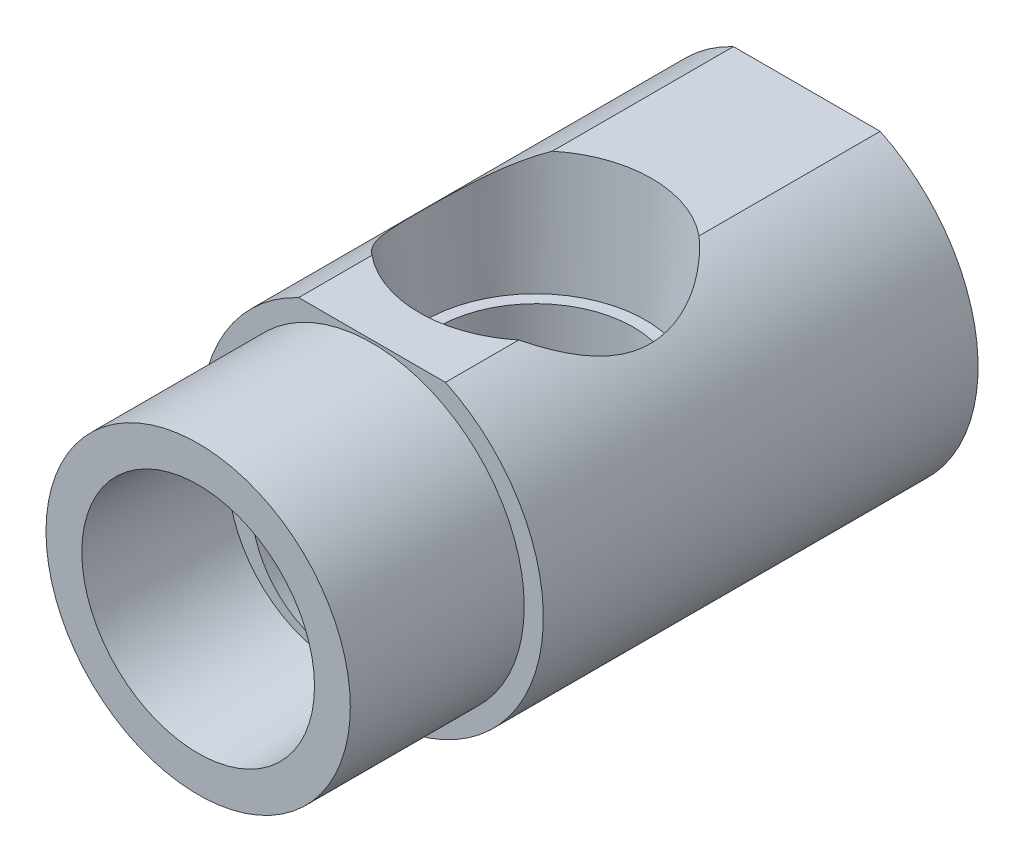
ISO-10303-21;
HEADER;
FILE_DESCRIPTION(('STEP AP214'),'2;1');
FILE_NAME('part.step','',(''),(''),'','','');
FILE_SCHEMA(('AUTOMOTIVE_DESIGN { 1 0 10303 214 1 1 1 1 }'));
ENDSEC;
DATA;
#1=APPLICATION_CONTEXT('core data for automotive mechanical design processes');
#2=APPLICATION_PROTOCOL_DEFINITION('international standard','automotive_design',2000,#1);
#3=PRODUCT_CONTEXT('',#1,'mechanical');
#4=PRODUCT('Part','Part','',(#3));
#5=PRODUCT_RELATED_PRODUCT_CATEGORY('part','',(#4));
#6=PRODUCT_DEFINITION_FORMATION('','',#4);
#7=PRODUCT_DEFINITION_CONTEXT('part definition',#1,'design');
#8=PRODUCT_DEFINITION('design','',#6,#7);
#9=PRODUCT_DEFINITION_SHAPE('','',#8);
#10=(LENGTH_UNIT() NAMED_UNIT(*) SI_UNIT(.MILLI.,.METRE.));
#11=(NAMED_UNIT(*) PLANE_ANGLE_UNIT() SI_UNIT($,.RADIAN.));
#12=(NAMED_UNIT(*) SI_UNIT($,.STERADIAN.) SOLID_ANGLE_UNIT());
#13=UNCERTAINTY_MEASURE_WITH_UNIT(LENGTH_MEASURE(1.E-05),#10,'distance_accuracy_value','');
#14=(GEOMETRIC_REPRESENTATION_CONTEXT(3) GLOBAL_UNCERTAINTY_ASSIGNED_CONTEXT((#13)) GLOBAL_UNIT_ASSIGNED_CONTEXT((#10,
#11,#12)) REPRESENTATION_CONTEXT('',''));
#15=CARTESIAN_POINT('',(0.,0.,0.));
#16=DIRECTION('',(0.,0.,1.));
#17=DIRECTION('',(1.,0.,0.));
#18=AXIS2_PLACEMENT_3D('',#15,#16,#17);
#19=CARTESIAN_POINT('',(0.,-5.49601282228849,-30.7715128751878));
#20=DIRECTION('',(0.,-0.213279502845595,-0.976991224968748));
#21=DIRECTION('',(0.,0.976991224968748,-0.213279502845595));
#22=AXIS2_PLACEMENT_3D('',#19,#20,#21);
#23=CYLINDRICAL_SURFACE('',#22,6.27107494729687);
#24=CARTESIAN_POINT('',(6.1733996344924,-5.4473725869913,-25.379403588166));
#25=CARTESIAN_POINT('',(6.16556245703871,-5.4615694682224,-25.2387089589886));
#26=CARTESIAN_POINT('',(6.15770208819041,-5.47308176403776,-25.0977284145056));
#27=CARTESIAN_POINT('',(6.14232757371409,-5.4903692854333,-24.815371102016));
#28=CARTESIAN_POINT('',(6.1348134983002,-5.4961433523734,-24.6739942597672));
#29=CARTESIAN_POINT('',(6.12053666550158,-5.50157705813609,-24.3912552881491));
#30=CARTESIAN_POINT('',(6.11377297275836,-5.50124439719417,-24.249893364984));
#31=CARTESIAN_POINT('',(6.10130458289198,-5.49432900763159,-23.9672962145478));
#32=CARTESIAN_POINT('',(6.09559978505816,-5.48774687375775,-23.8260609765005));
#33=CARTESIAN_POINT('',(6.08061165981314,-5.4588933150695,-23.4071952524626));
#34=CARTESIAN_POINT('',(6.07322064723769,-5.42759803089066,-23.1300732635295));
#35=CARTESIAN_POINT('',(6.0641492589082,-5.34298500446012,-22.5792315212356));
#36=CARTESIAN_POINT('',(6.06246861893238,-5.28966828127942,-22.305511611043));
#37=CARTESIAN_POINT('',(6.06351201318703,-5.20525205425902,-21.9374242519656));
#38=CARTESIAN_POINT('',(6.06409521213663,-5.18198291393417,-21.8411718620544));
#39=CARTESIAN_POINT('',(6.06581815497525,-5.13337299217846,-21.6492146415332));
#40=CARTESIAN_POINT('',(6.06695777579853,-5.10803266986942,-21.5535096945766));
#41=CARTESIAN_POINT('',(6.06974140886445,-5.05531295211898,-21.3620893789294));
#42=CARTESIAN_POINT('',(6.07138824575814,-5.02792280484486,-21.2663770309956));
#43=CARTESIAN_POINT('',(6.07511895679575,-4.97140456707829,-21.0754629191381));
#44=CARTESIAN_POINT('',(6.0772028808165,-4.94227627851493,-20.9802612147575));
#45=CARTESIAN_POINT('',(6.0794725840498,-4.91236883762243,-20.8853125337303));
#46=B_SPLINE_CURVE_WITH_KNOTS('',3,(#24,#25,#26,#27,#28,#29,#30,#31,#32,#33,#34,#35,#36,#37,#38,
#39,#40,#41,#42,#43,#44,#45),.UNSPECIFIED.,.F.,.F.,(4,2,2,2,2,2,2,2,2,2,4),(0.,
0.424876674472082,0.849839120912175,1.27426575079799,1.69865199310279,2.53445728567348,
3.37022390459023,3.66729136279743,3.96429314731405,4.26297977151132,4.56170049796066),.UNSPECIFIED.);
#47=CARTESIAN_POINT('',(6.0919781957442,-5.48065691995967,-23.7243491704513));
#48=VERTEX_POINT('',#47);
#49=CARTESIAN_POINT('',(6.07945740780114,-4.91256883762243,-20.8859474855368));
#50=VERTEX_POINT('',#49);
#51=EDGE_CURVE('E11',#48,#50,#46,.T.);
#52=ORIENTED_EDGE('',*,*,#51,.F.);
#53=CARTESIAN_POINT('',(0.,-4.02688128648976,-24.0417118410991));
#54=DIRECTION('',(0.,-0.213279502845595,-0.976991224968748));
#55=DIRECTION('',(0.,0.976991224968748,-0.213279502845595));
#56=AXIS2_PLACEMENT_3D('',#53,#54,#55);
#57=CIRCLE('',#56,6.27107494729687);
#58=CARTESIAN_POINT('',(-6.09197819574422,-5.48065691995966,-23.7243491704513));
#59=VERTEX_POINT('',#58);
#60=EDGE_CURVE('E371',#48,#59,#57,.T.);
#61=ORIENTED_EDGE('',*,*,#60,.T.);
#62=CARTESIAN_POINT('',(-6.0794725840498,-4.91236883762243,-20.8853125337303));
#63=CARTESIAN_POINT('',(-6.07573596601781,-4.96156959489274,-21.0415340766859));
#64=CARTESIAN_POINT('',(-6.07250567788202,-5.00867685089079,-21.1984581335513));
#65=CARTESIAN_POINT('',(-6.06733933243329,-5.09790632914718,-21.5138310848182));
#66=CARTESIAN_POINT('',(-6.06540402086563,-5.14002566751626,-21.6722808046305));
#67=CARTESIAN_POINT('',(-6.06311126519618,-5.21852158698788,-21.9910465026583));
#68=CARTESIAN_POINT('',(-6.06275781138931,-5.25488342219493,-22.1513661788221));
#69=CARTESIAN_POINT('',(-6.06387215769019,-5.32085768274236,-22.4733616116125));
#70=CARTESIAN_POINT('',(-6.06533960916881,-5.3504713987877,-22.63503710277));
#71=CARTESIAN_POINT('',(-6.07017346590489,-5.40162696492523,-22.9562006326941));
#72=CARTESIAN_POINT('',(-6.07349982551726,-5.42332359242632,-23.1156644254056));
#73=CARTESIAN_POINT('',(-6.08199666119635,-5.4589193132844,-23.4354291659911));
#74=CARTESIAN_POINT('',(-6.08716726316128,-5.4728178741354,-23.5957301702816));
#75=CARTESIAN_POINT('',(-6.09913989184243,-5.49250235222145,-23.9165225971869));
#76=CARTESIAN_POINT('',(-6.10593942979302,-5.49830055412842,-24.0770133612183));
#77=CARTESIAN_POINT('',(-6.12079517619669,-5.5018556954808,-24.3980021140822));
#78=CARTESIAN_POINT('',(-6.1288511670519,-5.49961402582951,-24.5585000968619));
#79=CARTESIAN_POINT('',(-6.14017047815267,-5.49144391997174,-24.7738735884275));
#80=CARTESIAN_POINT('',(-6.1431078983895,-5.48890223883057,-24.8289128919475));
#81=CARTESIAN_POINT('',(-6.1490461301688,-5.48293652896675,-24.9389390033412));
#82=CARTESIAN_POINT('',(-6.15204693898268,-5.47951253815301,-24.9939258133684));
#83=CARTESIAN_POINT('',(-6.15809935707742,-5.47179157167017,-25.104037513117));
#84=CARTESIAN_POINT('',(-6.16115111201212,-5.46749144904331,-25.1591621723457));
#85=CARTESIAN_POINT('',(-6.16727000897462,-5.45805345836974,-25.2693393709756));
#86=CARTESIAN_POINT('',(-6.17033715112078,-5.45291558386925,-25.3243919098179));
#87=CARTESIAN_POINT('',(-6.1733996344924,-5.4473725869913,-25.379403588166));
#88=B_SPLINE_CURVE_WITH_KNOTS('',3,(#62,#63,#64,#65,#66,#67,#68,#69,#70,#71,#72,#73,#74,#75,#76,
#77,#78,#79,#80,#81,#82,#83,#84,#85,#86,#87),.UNSPECIFIED.,.F.,.F.,(4,2,2,2,2,2,2,2,2,2,2,2,4),
(0.,0.491514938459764,0.983312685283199,1.47635031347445,1.96929355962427,2.45200558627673,
2.93475057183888,3.41676264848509,3.89869134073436,4.06421563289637,4.22973281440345,
4.39585533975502,4.56197914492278),.UNSPECIFIED.);
#89=CARTESIAN_POINT('',(-6.07945740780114,-4.91256883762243,-20.8859474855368));
#90=VERTEX_POINT('',#89);
#91=EDGE_CURVE('E25',#90,#59,#88,.T.);
#92=ORIENTED_EDGE('',*,*,#91,.F.);
#93=CARTESIAN_POINT('',(-3.43816526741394,2.5781,-18.3756745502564));
#94=CARTESIAN_POINT('',(-3.53420964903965,2.50213365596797,-18.428409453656));
#95=CARTESIAN_POINT('',(-3.62756877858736,2.42382017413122,-18.4825369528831));
#96=CARTESIAN_POINT('',(-3.80900853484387,2.26293542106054,-18.5931302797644));
#97=CARTESIAN_POINT('',(-3.89709140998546,2.18036599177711,-18.6495950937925));
#98=CARTESIAN_POINT('',(-4.15335140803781,1.92715515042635,-18.8216726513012));
#99=CARTESIAN_POINT('',(-4.31391172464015,1.75071309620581,-18.9401765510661));
#100=CARTESIAN_POINT('',(-4.61757767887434,1.38252202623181,-19.183276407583));
#101=CARTESIAN_POINT('',(-4.76042428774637,1.1906013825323,-19.3079322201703));
#102=CARTESIAN_POINT('',(-5.02726735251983,0.794965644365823,-19.5588461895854));
#103=CARTESIAN_POINT('',(-5.15125723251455,0.591246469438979,-19.6851048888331));
#104=CARTESIAN_POINT('',(-5.37055249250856,0.191876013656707,-19.92432565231));
#105=CARTESIAN_POINT('',(-5.46744355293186,-0.00281214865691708,-20.0374487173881));
#106=CARTESIAN_POINT('',(-5.64649204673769,-0.401589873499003,-20.2590614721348));
#107=CARTESIAN_POINT('',(-5.72864155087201,-0.605684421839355,-20.3675486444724));
#108=CARTESIAN_POINT('',(-5.87740150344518,-1.02268014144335,-20.5747506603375));
#109=CARTESIAN_POINT('',(-5.94409974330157,-1.23552304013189,-20.6735187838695));
#110=CARTESIAN_POINT('',(-6.06130704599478,-1.6719986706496,-20.8551584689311));
#111=CARTESIAN_POINT('',(-6.11184655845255,-1.8956101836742,-20.9380598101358));
#112=CARTESIAN_POINT('',(-6.18661951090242,-2.31214581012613,-21.0647880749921));
#113=CARTESIAN_POINT('',(-6.21398515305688,-2.50312597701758,-21.1130012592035));
#114=CARTESIAN_POINT('',(-6.25374440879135,-2.89104100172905,-21.1839930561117));
#115=CARTESIAN_POINT('',(-6.26619491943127,-3.08795027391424,-21.2068683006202));
#116=CARTESIAN_POINT('',(-6.27178326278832,-3.38556027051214,-21.2171231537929));
#117=CARTESIAN_POINT('',(-6.27141848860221,-3.48580077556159,-21.2164465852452));
#118=CARTESIAN_POINT('',(-6.2659756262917,-3.68575522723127,-21.2064847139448));
#119=CARTESIAN_POINT('',(-6.26089741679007,-3.78546916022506,-21.1971991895));
#120=CARTESIAN_POINT('',(-6.24590599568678,-3.98355459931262,-21.1700621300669));
#121=CARTESIAN_POINT('',(-6.23598289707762,-4.08192293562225,-21.1521930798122));
#122=CARTESIAN_POINT('',(-6.21135524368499,-4.27622558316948,-21.1084968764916));
#123=CARTESIAN_POINT('',(-6.19665193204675,-4.37216052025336,-21.0826717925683));
#124=CARTESIAN_POINT('',(-6.16585149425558,-4.54317081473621,-21.0295754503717));
#125=CARTESIAN_POINT('',(-6.1505409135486,-4.61876639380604,-21.003496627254));
#126=CARTESIAN_POINT('',(-6.1170900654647,-4.7674707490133,-20.9474755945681));
#127=CARTESIAN_POINT('',(-6.09896284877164,-4.84058918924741,-20.9175513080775));
#128=CARTESIAN_POINT('',(-6.07945740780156,-4.91256883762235,-20.8859474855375));
#129=B_SPLINE_CURVE_WITH_KNOTS('',3,(#93,#94,#95,#96,#97,#98,#99,#100,#101,#102,#103,#104,#105,
#106,#107,#108,#109,#110,#111,#112,#113,#114,#115,#116,#117,#118,#119,#120,#121,#122,#123,#124,
#125,#126,#127,#128),.UNSPECIFIED.,.F.,.F.,(4,2,2,2,2,2,2,2,2,2,2,2,2,2,2,2,2,4),(0.,
0.399852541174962,0.799533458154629,1.59734289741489,2.40570735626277,3.21435307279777,
3.94912566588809,4.68429230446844,5.41517338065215,6.14466894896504,6.73965736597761,
7.33236876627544,7.63267731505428,7.93299359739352,8.23392531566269,8.53477883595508,
8.77886209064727,9.02184639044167),.UNSPECIFIED.);
#130=CARTESIAN_POINT('',(-3.43816526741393,2.5781,-18.3756745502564));
#131=VERTEX_POINT('',#130);
#132=EDGE_CURVE('E247',#131,#90,#129,.T.);
#133=ORIENTED_EDGE('',*,*,#132,.F.);
#134=CARTESIAN_POINT('',(0.,2.5781,6.21440124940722));
#135=DIRECTION('',(0.,-1.,0.));
#136=DIRECTION('',(0.,0.,-1.));
#137=AXIS2_PLACEMENT_3D('',#134,#135,#136);
#138=ELLIPSE('',#137,29.4030831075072,6.27107494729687);
#139=CARTESIAN_POINT('',(-3.70420429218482,2.5781,-17.5111003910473));
#140=VERTEX_POINT('',#139);
#141=EDGE_CURVE('E164',#140,#131,#138,.T.);
#142=ORIENTED_EDGE('',*,*,#141,.F.);
#143=CARTESIAN_POINT('',(3.70443310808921,2.5779,-17.5112311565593));
#144=CARTESIAN_POINT('',(3.5970951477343,2.6717022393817,-17.4498979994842));
#145=CARTESIAN_POINT('',(3.48624807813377,2.76246365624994,-17.390113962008));
#146=CARTESIAN_POINT('',(3.25722442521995,2.93724678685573,-17.274299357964));
#147=CARTESIAN_POINT('',(3.13903756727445,3.02125865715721,-17.2182742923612));
#148=CARTESIAN_POINT('',(2.77171640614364,3.26294533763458,-17.0563063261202));
#149=CARTESIAN_POINT('',(2.51136843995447,3.4088911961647,-16.9573794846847));
#150=CARTESIAN_POINT('',(2.00590411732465,3.64101531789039,-16.7990954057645));
#151=CARTESIAN_POINT('',(1.76465040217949,3.73294421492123,-16.7359858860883));
#152=CARTESIAN_POINT('',(1.3918460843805,3.8448405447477,-16.6589357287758));
#153=CARTESIAN_POINT('',(1.26590096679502,3.87778462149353,-16.6362032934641));
#154=CARTESIAN_POINT('',(1.01102318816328,3.93449294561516,-16.5970260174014));
#155=CARTESIAN_POINT('',(0.88209180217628,3.95826103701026,-16.5805785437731));
#156=CARTESIAN_POINT('',(0.621210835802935,3.99626495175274,-16.5542618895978));
#157=CARTESIAN_POINT('',(0.489246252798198,4.01043128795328,-16.5444406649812));
#158=CARTESIAN_POINT('',(0.224278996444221,4.02864136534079,-16.5318135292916));
#159=CARTESIAN_POINT('',(0.0912763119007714,4.03268499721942,-16.529007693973));
#160=CARTESIAN_POINT('',(-0.174608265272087,4.03055434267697,-16.530485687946));
#161=CARTESIAN_POINT('',(-0.307490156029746,4.02437990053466,-16.5347696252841));
#162=CARTESIAN_POINT('',(-0.57197883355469,4.00195638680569,-16.5503152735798));
#163=CARTESIAN_POINT('',(-0.703585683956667,3.98570782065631,-16.5615766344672));
#164=CARTESIAN_POINT('',(-0.952564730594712,3.94542468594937,-16.5894601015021));
#165=CARTESIAN_POINT('',(-1.07014065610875,3.9222351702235,-16.6054997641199));
#166=CARTESIAN_POINT('',(-1.30270188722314,3.86823414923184,-16.6427932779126));
#167=CARTESIAN_POINT('',(-1.41768640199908,3.83742035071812,-16.6640486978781));
#168=CARTESIAN_POINT('',(-1.75828691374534,3.73411141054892,-16.7351741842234));
#169=CARTESIAN_POINT('',(-1.97917196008,3.65081200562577,-16.7923593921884));
#170=CARTESIAN_POINT('',(-2.4747737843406,3.42843643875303,-16.9441130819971));
#171=CARTESIAN_POINT('',(-2.74340861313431,3.28002750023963,-17.0447910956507));
#172=CARTESIAN_POINT('',(-3.12208662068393,3.03308957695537,-17.2103752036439));
#173=CARTESIAN_POINT('',(-3.24397151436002,2.94698668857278,-17.2678239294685));
#174=CARTESIAN_POINT('',(-3.47994047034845,2.76762000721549,-17.3867169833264));
#175=CARTESIAN_POINT('',(-3.59403717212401,2.67436836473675,-17.4481545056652));
#176=CARTESIAN_POINT('',(-3.70443310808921,2.5779,-17.5112311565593));
#177=B_SPLINE_CURVE_WITH_KNOTS('',3,(#143,#144,#145,#146,#147,#148,#149,#150,#151,#152,#153,
#154,#155,#156,#157,#158,#159,#160,#161,#162,#163,#164,#165,#166,#167,#168,#169,#170,#171,#172,
#173,#174,#175,#176),.UNSPECIFIED.,.F.,.F.,(4,2,2,2,2,2,2,2,2,2,2,2,2,2,2,2,4),(0.,
0.465395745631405,0.931458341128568,1.87031315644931,2.66409541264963,3.06012170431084,
3.45598191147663,3.85467718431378,4.25337676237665,4.65208241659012,5.05076806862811,
5.41310015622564,5.77554135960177,6.50156806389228,7.46553256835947,7.94494386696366,
8.423557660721),.UNSPECIFIED.);
#178=CARTESIAN_POINT('',(3.70420429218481,2.5781,-17.5111003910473));
#179=VERTEX_POINT('',#178);
#180=EDGE_CURVE('E157',#179,#140,#177,.T.);
#181=ORIENTED_EDGE('',*,*,#180,.F.);
#182=CARTESIAN_POINT('',(3.43816526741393,2.5781,-18.3756745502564));
#183=VERTEX_POINT('',#182);
#184=EDGE_CURVE('E251',#183,#179,#138,.T.);
#185=ORIENTED_EDGE('',*,*,#184,.F.);
#186=CARTESIAN_POINT('',(6.07945740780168,-4.91256883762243,-20.8859474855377));
#187=CARTESIAN_POINT('',(6.1055665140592,-4.81628571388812,-20.9282553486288));
#188=CARTESIAN_POINT('',(6.1292001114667,-4.71788768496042,-20.9675365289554));
#189=CARTESIAN_POINT('',(6.17127100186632,-4.51721289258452,-21.0387171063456));
#190=CARTESIAN_POINT('',(6.18969993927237,-4.41493018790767,-21.0706046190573));
#191=CARTESIAN_POINT('',(6.22078607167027,-4.20877254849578,-21.1250960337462));
#192=CARTESIAN_POINT('',(6.23352902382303,-4.10494753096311,-21.1478373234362));
#193=CARTESIAN_POINT('',(6.25351902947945,-3.89521388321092,-21.1837813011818));
#194=CARTESIAN_POINT('',(6.26077029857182,-3.78930691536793,-21.1969913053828));
#195=CARTESIAN_POINT('',(6.26988193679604,-3.57562852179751,-21.2136204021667));
#196=CARTESIAN_POINT('',(6.27169797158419,-3.46784893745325,-21.2169589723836));
#197=CARTESIAN_POINT('',(6.27007497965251,-3.25243674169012,-21.213989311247));
#198=CARTESIAN_POINT('',(6.26663252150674,-3.1448042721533,-21.2076747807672));
#199=CARTESIAN_POINT('',(6.24897707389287,-2.82330740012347,-21.1755363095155));
#200=CARTESIAN_POINT('',(6.22742666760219,-2.61110690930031,-21.1365009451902));
#201=CARTESIAN_POINT('',(6.17571682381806,-2.24792162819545,-21.0463256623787));
#202=CARTESIAN_POINT('',(6.14906219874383,-2.09490854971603,-21.000660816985));
#203=CARTESIAN_POINT('',(6.08782210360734,-1.7938593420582,-20.8990620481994));
#204=CARTESIAN_POINT('',(6.05323128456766,-1.64582664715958,-20.843121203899));
#205=CARTESIAN_POINT('',(5.97667688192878,-1.35399094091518,-20.7236563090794));
#206=CARTESIAN_POINT('',(5.93467802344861,-1.21021219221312,-20.660096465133));
#207=CARTESIAN_POINT('',(5.84384572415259,-0.927238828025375,-20.5278147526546));
#208=CARTESIAN_POINT('',(5.7950100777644,-0.788045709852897,-20.4590912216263));
#209=CARTESIAN_POINT('',(5.65280425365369,-0.414233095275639,-20.2669169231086));
#210=CARTESIAN_POINT('',(5.55288026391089,-0.183853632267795,-20.1400218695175));
#211=CARTESIAN_POINT('',(5.33346573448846,0.265024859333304,-19.8818832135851));
#212=CARTESIAN_POINT('',(5.21396024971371,0.483514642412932,-19.7506363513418));
#213=CARTESIAN_POINT('',(4.95543030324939,0.907202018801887,-19.4887158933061));
#214=CARTESIAN_POINT('',(4.81650190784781,1.11245817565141,-19.3580425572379));
#215=CARTESIAN_POINT('',(4.51780134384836,1.50937282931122,-19.1003059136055));
#216=CARTESIAN_POINT('',(4.35805057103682,1.70104497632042,-18.9732390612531));
#217=CARTESIAN_POINT('',(4.07265974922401,2.00812326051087,-18.7667856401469));
#218=CARTESIAN_POINT('',(3.95308721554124,2.12787528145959,-18.685465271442));
#219=CARTESIAN_POINT('',(3.70351796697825,2.35932971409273,-18.527069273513));
#220=CARTESIAN_POINT('',(3.57351074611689,2.47102379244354,-18.449998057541));
#221=CARTESIAN_POINT('',(3.43816526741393,2.5781,-18.3756745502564));
#222=B_SPLINE_CURVE_WITH_KNOTS('',3,(#186,#187,#188,#189,#190,#191,#192,#193,#194,#195,#196,
#197,#198,#199,#200,#201,#202,#203,#204,#205,#206,#207,#208,#209,#210,#211,#212,#213,#214,#215,
#216,#217,#218,#219,#220,#221),.UNSPECIFIED.,.F.,.F.,(4,2,2,2,2,2,2,2,2,2,2,2,2,2,2,2,2,4),(0.,
0.325146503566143,0.650812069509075,0.971384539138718,1.29171067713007,1.61464263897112,
1.93778541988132,2.58484969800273,3.06995922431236,3.55539667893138,4.04321131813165,
4.53118369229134,5.37412815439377,6.2177189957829,7.05727604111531,7.89597711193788,
8.45876490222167,9.0221266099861),.UNSPECIFIED.);
#223=EDGE_CURVE('E245',#50,#183,#222,.T.);
#224=ORIENTED_EDGE('',*,*,#223,.F.);
#225=EDGE_LOOP('',(#52,#61,#92,#133,#142,#181,#185,#224));
#226=FACE_BOUND('',#225,.T.);
#227=CARTESIAN_POINT('',(0.,-0.997946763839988,-10.1667617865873));
#228=DIRECTION('',(0.,0.,1.));
#229=DIRECTION('',(0.,-1.,0.));
#230=AXIS2_PLACEMENT_3D('',#227,#228,#229);
#231=ELLIPSE('',#230,6.41876281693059,6.27107494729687);
#232=CARTESIAN_POINT('',(0.,-7.41670958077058,-10.1667617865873));
#233=VERTEX_POINT('',#232);
#234=EDGE_CURVE('E20',#233,#233,#231,.T.);
#235=ORIENTED_EDGE('',*,*,#234,.T.);
#236=EDGE_LOOP('',(#235));
#237=FACE_BOUND('',#236,.T.);
#238=ADVANCED_FACE('F16',(#226,#237),#23,.F.);
#239=CARTESIAN_POINT('',(-5.3594,11.3032925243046,0.));
#240=DIRECTION('',(0.,-1.,0.));
#241=DIRECTION('',(0.,0.,-1.));
#242=AXIS2_PLACEMENT_3D('',#239,#240,#241);
#243=PLANE('',#242);
#244=DIRECTION('',(0.,0.,-1.));
#245=VECTOR('',#244,1.);
#246=CARTESIAN_POINT('',(5.3594,11.3032925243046,0.));
#247=LINE('',#246,#245);
#248=CARTESIAN_POINT('',(5.3594,11.3032925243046,-12.7));
#249=VERTEX_POINT('',#248);
#250=CARTESIAN_POINT('',(5.3594,11.3032925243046,-18.05323946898));
#251=VERTEX_POINT('',#250);
#252=EDGE_CURVE('E132',#249,#251,#247,.T.);
#253=ORIENTED_EDGE('',*,*,#252,.T.);
#254=CARTESIAN_POINT('',(0.,11.3032925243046,-24.638));
#255=DIRECTION('',(0.,-1.,0.));
#256=DIRECTION('',(0.,0.,-1.));
#257=AXIS2_PLACEMENT_3D('',#254,#255,#256);
#258=CIRCLE('',#257,8.49012600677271);
#259=CARTESIAN_POINT('',(-5.3594,11.3032925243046,-18.05323946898));
#260=VERTEX_POINT('',#259);
#261=EDGE_CURVE('E118',#251,#260,#258,.T.);
#262=ORIENTED_EDGE('',*,*,#261,.T.);
#263=DIRECTION('',(0.,0.,-1.));
#264=VECTOR('',#263,1.);
#265=CARTESIAN_POINT('',(-5.3594,11.3032925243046,0.));
#266=LINE('',#265,#264);
#267=CARTESIAN_POINT('',(-5.3594,11.3032925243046,-12.7));
#268=VERTEX_POINT('',#267);
#269=EDGE_CURVE('E143',#268,#260,#266,.T.);
#270=ORIENTED_EDGE('',*,*,#269,.F.);
#271=DIRECTION('',(1.,0.,0.));
#272=VECTOR('',#271,1.);
#273=CARTESIAN_POINT('',(-11.1125,11.3032925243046,-12.7));
#274=LINE('',#273,#272);
#275=EDGE_CURVE('E140',#268,#249,#274,.T.);
#276=ORIENTED_EDGE('',*,*,#275,.T.);
#277=EDGE_LOOP('',(#253,#262,#270,#276));
#278=FACE_BOUND('',#277,.T.);
#279=ADVANCED_FACE('F138',(#278),#243,.F.);
#280=CARTESIAN_POINT('',(-7.29488,0.,0.));
#281=DIRECTION('',(0.,0.,1.));
#282=DIRECTION('',(1.,0.,0.));
#283=AXIS2_PLACEMENT_3D('',#280,#281,#282);
#284=PLANE('',#283);
#285=CARTESIAN_POINT('',(0.,0.,0.));
#286=DIRECTION('',(0.,0.,1.));
#287=DIRECTION('',(1.,0.,0.));
#288=AXIS2_PLACEMENT_3D('',#285,#286,#287);
#289=CIRCLE('',#288,8.4963);
#290=CARTESIAN_POINT('',(8.4963,0.,0.));
#291=VERTEX_POINT('',#290);
#292=EDGE_CURVE('E229',#291,#291,#289,.T.);
#293=ORIENTED_EDGE('',*,*,#292,.F.);
#294=EDGE_LOOP('',(#293));
#295=FACE_BOUND('',#294,.T.);
#296=CARTESIAN_POINT('',(0.,0.,0.));
#297=DIRECTION('',(0.,0.,1.));
#298=DIRECTION('',(1.,0.,0.));
#299=AXIS2_PLACEMENT_3D('',#296,#297,#298);
#300=CIRCLE('',#299,11.1125);
#301=CARTESIAN_POINT('',(11.1125,0.,0.));
#302=VERTEX_POINT('',#301);
#303=EDGE_CURVE('E224',#302,#302,#300,.F.);
#304=ORIENTED_EDGE('',*,*,#303,.F.);
#305=EDGE_LOOP('',(#304));
#306=FACE_BOUND('',#305,.T.);
#307=ADVANCED_FACE('F18',(#295,#306),#284,.T.);
#308=CARTESIAN_POINT('',(-12.5095,0.,-44.45));
#309=DIRECTION('',(0.,0.,-1.));
#310=DIRECTION('',(-1.,0.,0.));
#311=AXIS2_PLACEMENT_3D('',#308,#309,#310);
#312=PLANE('',#311);
#313=DIRECTION('',(1.,0.,0.));
#314=VECTOR('',#313,1.);
#315=CARTESIAN_POINT('',(-3.66617420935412,6.35,-44.45));
#316=LINE('',#315,#314);
#317=CARTESIAN_POINT('',(-3.66617420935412,6.35,-44.45));
#318=VERTEX_POINT('',#317);
#319=CARTESIAN_POINT('',(3.66617420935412,6.35,-44.45));
#320=VERTEX_POINT('',#319);
#321=EDGE_CURVE('E369',#318,#320,#316,.T.);
#322=ORIENTED_EDGE('',*,*,#321,.F.);
#323=DIRECTION('',(0.5,0.866025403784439,0.));
#324=VECTOR('',#323,1.);
#325=CARTESIAN_POINT('',(-7.33234841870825,0.,-44.45));
#326=LINE('',#325,#324);
#327=CARTESIAN_POINT('',(-7.33234841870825,0.,-44.45));
#328=VERTEX_POINT('',#327);
#329=EDGE_CURVE('E353',#328,#318,#326,.T.);
#330=ORIENTED_EDGE('',*,*,#329,.F.);
#331=DIRECTION('',(-0.5,0.866025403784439,0.));
#332=VECTOR('',#331,1.);
#333=CARTESIAN_POINT('',(-3.66617420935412,-6.35,-44.45));
#334=LINE('',#333,#332);
#335=CARTESIAN_POINT('',(-3.66617420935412,-6.35,-44.45));
#336=VERTEX_POINT('',#335);
#337=EDGE_CURVE('E357',#336,#328,#334,.T.);
#338=ORIENTED_EDGE('',*,*,#337,.F.);
#339=DIRECTION('',(-1.,0.,0.));
#340=VECTOR('',#339,1.);
#341=CARTESIAN_POINT('',(3.66617420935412,-6.35,-44.45));
#342=LINE('',#341,#340);
#343=CARTESIAN_POINT('',(3.66617420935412,-6.35,-44.45));
#344=VERTEX_POINT('',#343);
#345=EDGE_CURVE('E360',#344,#336,#342,.T.);
#346=ORIENTED_EDGE('',*,*,#345,.F.);
#347=DIRECTION('',(-0.5,-0.866025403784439,0.));
#348=VECTOR('',#347,1.);
#349=CARTESIAN_POINT('',(7.33234841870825,0.,-44.45));
#350=LINE('',#349,#348);
#351=CARTESIAN_POINT('',(7.33234841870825,0.,-44.45));
#352=VERTEX_POINT('',#351);
#353=EDGE_CURVE('E363',#352,#344,#350,.T.);
#354=ORIENTED_EDGE('',*,*,#353,.F.);
#355=DIRECTION('',(0.5,-0.866025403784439,0.));
#356=VECTOR('',#355,1.);
#357=CARTESIAN_POINT('',(3.66617420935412,6.35,-44.45));
#358=LINE('',#357,#356);
#359=EDGE_CURVE('E366',#320,#352,#358,.T.);
#360=ORIENTED_EDGE('',*,*,#359,.F.);
#361=EDGE_LOOP('',(#322,#330,#338,#346,#354,#360));
#362=FACE_BOUND('',#361,.T.);
#363=DIRECTION('',(-1.,0.,0.));
#364=VECTOR('',#363,1.);
#365=CARTESIAN_POINT('',(-5.3594,11.3032925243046,-44.45));
#366=LINE('',#365,#364);
#367=CARTESIAN_POINT('',(5.3594,11.3032925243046,-44.45));
#368=VERTEX_POINT('',#367);
#369=CARTESIAN_POINT('',(-5.3594,11.3032925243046,-44.45));
#370=VERTEX_POINT('',#369);
#371=EDGE_CURVE('E145',#368,#370,#366,.T.);
#372=ORIENTED_EDGE('',*,*,#371,.F.);
#373=CARTESIAN_POINT('',(0.,0.,-44.45));
#374=DIRECTION('',(0.,0.,-1.));
#375=DIRECTION('',(-1.,0.,0.));
#376=AXIS2_PLACEMENT_3D('',#373,#374,#375);
#377=CIRCLE('',#376,12.5095);
#378=EDGE_CURVE('E153',#368,#370,#377,.T.);
#379=ORIENTED_EDGE('',*,*,#378,.T.);
#380=EDGE_LOOP('',(#372,#379));
#381=FACE_BOUND('',#380,.T.);
#382=ADVANCED_FACE('F195',(#362,#381),#312,.T.);
#383=CARTESIAN_POINT('',(0.,0.,-75.1971669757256));
#384=DIRECTION('',(0.,0.,-1.));
#385=DIRECTION('',(-1.,0.,0.));
#386=AXIS2_PLACEMENT_3D('',#383,#384,#385);
#387=CYLINDRICAL_SURFACE('',#386,12.5095);
#388=CARTESIAN_POINT('',(5.3589781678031,11.3034925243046,-18.0528826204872));
#389=CARTESIAN_POINT('',(5.54921369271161,11.2133234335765,-18.2138407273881));
#390=CARTESIAN_POINT('',(5.73165431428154,11.1209258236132,-18.382665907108));
#391=CARTESIAN_POINT('',(6.08048620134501,10.9340894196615,-18.7352208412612));
#392=CARTESIAN_POINT('',(6.24687354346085,10.8396501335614,-18.9189542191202));
#393=CARTESIAN_POINT('',(6.56420314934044,10.6505028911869,-19.3018126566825));
#394=CARTESIAN_POINT('',(6.71502345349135,10.5557980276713,-19.5010405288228));
#395=CARTESIAN_POINT('',(6.99914257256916,10.3695935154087,-19.9128637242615));
#396=CARTESIAN_POINT('',(7.1324444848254,10.2780933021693,-20.1254566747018));
#397=CARTESIAN_POINT('',(7.46650834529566,10.0401700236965,-20.7146742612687));
#398=CARTESIAN_POINT('',(7.65054804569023,9.89929381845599,-21.1034819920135));
#399=CARTESIAN_POINT('',(7.88323238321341,9.71350267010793,-21.7099632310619));
#400=CARTESIAN_POINT('',(7.95350713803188,9.65587918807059,-21.9157452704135));
#401=CARTESIAN_POINT('',(8.07900681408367,9.55112103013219,-22.3345154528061));
#402=CARTESIAN_POINT('',(8.1342346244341,9.50398434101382,-22.5475022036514));
#403=CARTESIAN_POINT('',(8.22106638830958,9.42891275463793,-22.944107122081));
#404=CARTESIAN_POINT('',(8.25505388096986,9.39910020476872,-23.1268521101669));
#405=CARTESIAN_POINT('',(8.31144289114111,9.34927427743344,-23.4954304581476));
#406=CARTESIAN_POINT('',(8.33384667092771,9.32925898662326,-23.6812632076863));
#407=CARTESIAN_POINT('',(8.36672861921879,9.29978140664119,-24.0547275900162));
#408=CARTESIAN_POINT('',(8.37721265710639,9.29031392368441,-24.2423582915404));
#409=CARTESIAN_POINT('',(8.3861052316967,9.28228778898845,-24.6181465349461));
#410=CARTESIAN_POINT('',(8.38451351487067,9.28372936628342,-24.8063040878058));
#411=CARTESIAN_POINT('',(8.36928475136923,9.29746017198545,-25.1816139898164));
#412=CARTESIAN_POINT('',(8.35565497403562,9.30974285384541,-25.3687668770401));
#413=CARTESIAN_POINT('',(8.3165791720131,9.3446659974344,-25.7408437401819));
#414=CARTESIAN_POINT('',(8.2911332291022,9.36730638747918,-25.925767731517));
#415=CARTESIAN_POINT('',(8.22876601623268,9.42213985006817,-26.292394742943));
#416=CARTESIAN_POINT('',(8.19183425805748,9.45434165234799,-26.4740946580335));
#417=CARTESIAN_POINT('',(8.10694730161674,9.52723048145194,-26.8332473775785));
#418=CARTESIAN_POINT('',(8.0589858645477,9.56792230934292,-27.0106977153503));
#419=CARTESIAN_POINT('',(7.93720028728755,9.66935365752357,-27.4109579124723));
#420=CARTESIAN_POINT('',(7.85990590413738,9.73249157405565,-27.6321095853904));
#421=CARTESIAN_POINT('',(7.68886075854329,9.86817719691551,-28.0649768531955));
#422=CARTESIAN_POINT('',(7.59510436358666,9.940728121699,-28.2766891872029));
#423=CARTESIAN_POINT('',(7.39186656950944,10.092770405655,-28.6902308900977));
#424=CARTESIAN_POINT('',(7.28236248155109,10.172271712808,-28.8920454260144));
#425=CARTESIAN_POINT('',(7.04849385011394,10.3357003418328,-29.2848508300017));
#426=CARTESIAN_POINT('',(6.92413202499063,10.4196268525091,-29.4758436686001));
#427=CARTESIAN_POINT('',(6.58695562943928,10.637641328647,-29.9510218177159));
#428=CARTESIAN_POINT('',(6.36373226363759,10.7733928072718,-30.2272036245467));
#429=CARTESIAN_POINT('',(6.00459360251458,10.9750283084,-30.6184604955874));
#430=CARTESIAN_POINT('',(5.88113847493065,11.0417585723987,-30.7447819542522));
#431=CARTESIAN_POINT('',(5.62611191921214,11.1738564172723,-30.9897690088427));
#432=CARTESIAN_POINT('',(5.49453878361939,11.2392237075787,-31.1084329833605));
#433=CARTESIAN_POINT('',(5.3589781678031,11.3034925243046,-31.2231173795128));
#434=B_SPLINE_CURVE_WITH_KNOTS('',3,(#388,#389,#390,#391,#392,#393,#394,#395,#396,#397,#398,
#399,#400,#401,#402,#403,#404,#405,#406,#407,#408,#409,#410,#411,#412,#413,#414,#415,#416,#417,
#418,#419,#420,#421,#422,#423,#424,#425,#426,#427,#428,#429,#430,#431,#432,#433),.UNSPECIFIED.,
.F.,.F.,(4,2,2,2,2,2,2,2,2,2,2,2,2,2,2,2,2,2,2,2,2,2,4),(0.,0.79468460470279,1.58956293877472,
2.39025916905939,3.19081364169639,4.54240556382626,5.21661127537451,5.89068744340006,
6.45486541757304,7.01893316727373,7.58272304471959,8.14652475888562,8.70998624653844,
9.27344383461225,9.83741745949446,10.4017108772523,11.1285534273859,11.8556451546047,
12.5837951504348,13.3118121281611,14.4492964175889,15.0154674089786,15.5817578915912),.UNSPECIFIED.);
#435=CARTESIAN_POINT('',(5.3594,11.3032925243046,-31.2227605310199));
#436=VERTEX_POINT('',#435);
#437=EDGE_CURVE('E32',#251,#436,#434,.T.);
#438=ORIENTED_EDGE('',*,*,#437,.F.);
#439=ORIENTED_EDGE('',*,*,#252,.F.);
#440=CARTESIAN_POINT('',(0.,0.,-12.7));
#441=DIRECTION('',(0.,0.,-1.));
#442=DIRECTION('',(-1.,0.,0.));
#443=AXIS2_PLACEMENT_3D('',#440,#441,#442);
#444=CIRCLE('',#443,12.5095);
#445=EDGE_CURVE('E151',#249,#268,#444,.T.);
#446=ORIENTED_EDGE('',*,*,#445,.T.);
#447=ORIENTED_EDGE('',*,*,#269,.T.);
#448=CARTESIAN_POINT('',(-5.3589781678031,11.3034925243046,-31.2231173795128));
#449=CARTESIAN_POINT('',(-5.54921369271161,11.2133234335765,-31.0621592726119));
#450=CARTESIAN_POINT('',(-5.73165431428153,11.1209258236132,-30.893334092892));
#451=CARTESIAN_POINT('',(-6.08048620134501,10.9340894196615,-30.5407791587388));
#452=CARTESIAN_POINT('',(-6.24687354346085,10.8396501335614,-30.3570457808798));
#453=CARTESIAN_POINT('',(-6.56420314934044,10.6505028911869,-29.9741873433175));
#454=CARTESIAN_POINT('',(-6.71502345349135,10.5557980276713,-29.7749594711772));
#455=CARTESIAN_POINT('',(-6.99914257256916,10.3695935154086,-29.3631362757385));
#456=CARTESIAN_POINT('',(-7.1324444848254,10.2780933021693,-29.1505433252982));
#457=CARTESIAN_POINT('',(-7.46650834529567,10.0401700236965,-28.5613257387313));
#458=CARTESIAN_POINT('',(-7.65054804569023,9.89929381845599,-28.1725180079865));
#459=CARTESIAN_POINT('',(-7.88323238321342,9.71350267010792,-27.5660367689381));
#460=CARTESIAN_POINT('',(-7.95350713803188,9.65587918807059,-27.3602547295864));
#461=CARTESIAN_POINT('',(-8.07900681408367,9.55112103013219,-26.9414845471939));
#462=CARTESIAN_POINT('',(-8.1342346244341,9.50398434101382,-26.7284977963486));
#463=CARTESIAN_POINT('',(-8.22106638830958,9.42891275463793,-26.331892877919));
#464=CARTESIAN_POINT('',(-8.25505388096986,9.39910020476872,-26.1491478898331));
#465=CARTESIAN_POINT('',(-8.31144289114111,9.34927427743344,-25.7805695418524));
#466=CARTESIAN_POINT('',(-8.33384667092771,9.32925898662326,-25.5947367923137));
#467=CARTESIAN_POINT('',(-8.36672861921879,9.29978140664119,-25.2212724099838));
#468=CARTESIAN_POINT('',(-8.37721265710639,9.29031392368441,-25.0336417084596));
#469=CARTESIAN_POINT('',(-8.3861052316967,9.28228778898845,-24.6578534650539));
#470=CARTESIAN_POINT('',(-8.38451351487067,9.28372936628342,-24.4696959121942));
#471=CARTESIAN_POINT('',(-8.36928475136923,9.29746017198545,-24.0943860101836));
#472=CARTESIAN_POINT('',(-8.35565497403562,9.30974285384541,-23.9072331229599));
#473=CARTESIAN_POINT('',(-8.3165791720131,9.3446659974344,-23.5351562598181));
#474=CARTESIAN_POINT('',(-8.2911332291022,9.36730638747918,-23.350232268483));
#475=CARTESIAN_POINT('',(-8.22876601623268,9.42213985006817,-22.983605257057));
#476=CARTESIAN_POINT('',(-8.19183425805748,9.45434165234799,-22.8019053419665));
#477=CARTESIAN_POINT('',(-8.10694730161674,9.52723048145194,-22.4427526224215));
#478=CARTESIAN_POINT('',(-8.0589858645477,9.56792230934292,-22.2653022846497));
#479=CARTESIAN_POINT('',(-7.93720028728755,9.66935365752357,-21.8650420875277));
#480=CARTESIAN_POINT('',(-7.85990590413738,9.73249157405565,-21.6438904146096));
#481=CARTESIAN_POINT('',(-7.68886075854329,9.86817719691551,-21.2110231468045));
#482=CARTESIAN_POINT('',(-7.59510436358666,9.940728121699,-20.9993108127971));
#483=CARTESIAN_POINT('',(-7.39186656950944,10.092770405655,-20.5857691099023));
#484=CARTESIAN_POINT('',(-7.28236248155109,10.172271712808,-20.3839545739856));
#485=CARTESIAN_POINT('',(-7.04849385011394,10.3357003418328,-19.9911491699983));
#486=CARTESIAN_POINT('',(-6.92413202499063,10.4196268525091,-19.8001563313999));
#487=CARTESIAN_POINT('',(-6.58695562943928,10.637641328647,-19.3249781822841));
#488=CARTESIAN_POINT('',(-6.36373226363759,10.7733928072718,-19.0487963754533));
#489=CARTESIAN_POINT('',(-6.00459360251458,10.9750283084,-18.6575395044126));
#490=CARTESIAN_POINT('',(-5.88113847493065,11.0417585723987,-18.5312180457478));
#491=CARTESIAN_POINT('',(-5.62611191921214,11.1738564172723,-18.2862309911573));
#492=CARTESIAN_POINT('',(-5.49453878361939,11.2392237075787,-18.1675670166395));
#493=CARTESIAN_POINT('',(-5.3589781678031,11.3034925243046,-18.0528826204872));
#494=B_SPLINE_CURVE_WITH_KNOTS('',3,(#448,#449,#450,#451,#452,#453,#454,#455,#456,#457,#458,
#459,#460,#461,#462,#463,#464,#465,#466,#467,#468,#469,#470,#471,#472,#473,#474,#475,#476,#477,
#478,#479,#480,#481,#482,#483,#484,#485,#486,#487,#488,#489,#490,#491,#492,#493),.UNSPECIFIED.,
.F.,.F.,(4,2,2,2,2,2,2,2,2,2,2,2,2,2,2,2,2,2,2,2,2,2,4),(0.,0.794684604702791,1.58956293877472,
2.39025916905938,3.19081364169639,4.54240556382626,5.21661127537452,5.89068744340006,
6.45486541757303,7.01893316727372,7.58272304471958,8.14652475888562,8.70998624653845,
9.27344383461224,9.83741745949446,10.4017108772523,11.1285534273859,11.8556451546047,
12.5837951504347,13.3118121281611,14.4492964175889,15.0154674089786,15.5817578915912),.UNSPECIFIED.);
#495=CARTESIAN_POINT('',(-5.3594,11.3032925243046,-31.2227605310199));
#496=VERTEX_POINT('',#495);
#497=EDGE_CURVE('E121',#496,#260,#494,.T.);
#498=ORIENTED_EDGE('',*,*,#497,.F.);
#499=EDGE_CURVE('E141',#496,#370,#266,.T.);
#500=ORIENTED_EDGE('',*,*,#499,.T.);
#501=ORIENTED_EDGE('',*,*,#378,.F.);
#502=EDGE_CURVE('E135',#436,#368,#247,.T.);
#503=ORIENTED_EDGE('',*,*,#502,.F.);
#504=EDGE_LOOP('',(#438,#439,#446,#447,#498,#500,#501,#503));
#505=FACE_BOUND('',#504,.T.);
#506=ADVANCED_FACE('F130',(#505),#387,.T.);
#507=CARTESIAN_POINT('',(-11.1125,0.,-12.7));
#508=DIRECTION('',(0.,0.,1.));
#509=DIRECTION('',(1.,0.,0.));
#510=AXIS2_PLACEMENT_3D('',#507,#508,#509);
#511=PLANE('',#510);
#512=ORIENTED_EDGE('',*,*,#275,.F.);
#513=ORIENTED_EDGE('',*,*,#445,.F.);
#514=EDGE_LOOP('',(#512,#513));
#515=FACE_BOUND('',#514,.T.);
#516=CARTESIAN_POINT('',(0.,0.,-12.7));
#517=DIRECTION('',(0.,0.,-1.));
#518=DIRECTION('',(-1.,0.,0.));
#519=AXIS2_PLACEMENT_3D('',#516,#517,#518);
#520=CIRCLE('',#519,11.1125);
#521=CARTESIAN_POINT('',(-11.1125,0.,-12.7));
#522=VERTEX_POINT('',#521);
#523=EDGE_CURVE('E148',#522,#522,#520,.T.);
#524=ORIENTED_EDGE('',*,*,#523,.T.);
#525=EDGE_LOOP('',(#524));
#526=FACE_BOUND('',#525,.T.);
#527=ADVANCED_FACE('F194',(#515,#526),#511,.T.);
#528=CARTESIAN_POINT('',(0.,0.,-75.1971669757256));
#529=DIRECTION('',(0.,0.,-1.));
#530=DIRECTION('',(-1.,0.,0.));
#531=AXIS2_PLACEMENT_3D('',#528,#529,#530);
#532=CYLINDRICAL_SURFACE('',#531,11.1125);
#533=ORIENTED_EDGE('',*,*,#523,.F.);
#534=EDGE_LOOP('',(#533));
#535=FACE_BOUND('',#534,.T.);
#536=ORIENTED_EDGE('',*,*,#303,.T.);
#537=EDGE_LOOP('',(#536));
#538=FACE_BOUND('',#537,.T.);
#539=ADVANCED_FACE('F318',(#535,#538),#532,.T.);
#540=ORIENTED_EDGE('',*,*,#499,.F.);
#541=EDGE_CURVE('E125',#496,#436,#258,.T.);
#542=ORIENTED_EDGE('',*,*,#541,.T.);
#543=ORIENTED_EDGE('',*,*,#502,.T.);
#544=ORIENTED_EDGE('',*,*,#371,.T.);
#545=EDGE_LOOP('',(#540,#542,#543,#544));
#546=FACE_BOUND('',#545,.T.);
#547=ADVANCED_FACE('F215',(#546),#243,.F.);
#548=CARTESIAN_POINT('',(-3.66617420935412,6.35,-38.1));
#549=DIRECTION('',(0.,1.,0.));
#550=DIRECTION('',(-1.,0.,0.));
#551=AXIS2_PLACEMENT_3D('',#548,#549,#550);
#552=PLANE('',#551);
#553=ORIENTED_EDGE('',*,*,#321,.T.);
#554=DIRECTION('',(0.,0.,-1.));
#555=VECTOR('',#554,1.);
#556=CARTESIAN_POINT('',(3.66617420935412,6.35,-38.1));
#557=LINE('',#556,#555);
#558=CARTESIAN_POINT('',(3.66617420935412,6.35,-38.1));
#559=VERTEX_POINT('',#558);
#560=EDGE_CURVE('E342',#559,#320,#557,.T.);
#561=ORIENTED_EDGE('',*,*,#560,.F.);
#562=DIRECTION('',(1.,0.,0.));
#563=VECTOR('',#562,1.);
#564=CARTESIAN_POINT('',(-3.66617420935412,6.35,-38.1));
#565=LINE('',#564,#563);
#566=CARTESIAN_POINT('',(-3.66617420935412,6.35,-38.1));
#567=VERTEX_POINT('',#566);
#568=EDGE_CURVE('E356',#567,#559,#565,.T.);
#569=ORIENTED_EDGE('',*,*,#568,.F.);
#570=DIRECTION('',(0.,0.,-1.));
#571=VECTOR('',#570,1.);
#572=CARTESIAN_POINT('',(-3.66617420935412,6.35,-38.1));
#573=LINE('',#572,#571);
#574=EDGE_CURVE('E338',#567,#318,#573,.T.);
#575=ORIENTED_EDGE('',*,*,#574,.T.);
#576=EDGE_LOOP('',(#553,#561,#569,#575));
#577=FACE_BOUND('',#576,.T.);
#578=ADVANCED_FACE('F299',(#577),#552,.F.);
#579=CARTESIAN_POINT('',(-7.33234841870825,0.,-38.1));
#580=DIRECTION('',(-0.866025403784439,0.5,0.));
#581=DIRECTION('',(-0.5,-0.866025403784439,0.));
#582=AXIS2_PLACEMENT_3D('',#579,#580,#581);
#583=PLANE('',#582);
#584=ORIENTED_EDGE('',*,*,#329,.T.);
#585=ORIENTED_EDGE('',*,*,#574,.F.);
#586=DIRECTION('',(0.5,0.866025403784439,0.));
#587=VECTOR('',#586,1.);
#588=CARTESIAN_POINT('',(-7.33234841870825,0.,-38.1));
#589=LINE('',#588,#587);
#590=CARTESIAN_POINT('',(-7.33234841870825,0.,-38.1));
#591=VERTEX_POINT('',#590);
#592=EDGE_CURVE('E346',#591,#567,#589,.T.);
#593=ORIENTED_EDGE('',*,*,#592,.F.);
#594=DIRECTION('',(0.,0.,-1.));
#595=VECTOR('',#594,1.);
#596=CARTESIAN_POINT('',(-7.33234841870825,0.,-38.1));
#597=LINE('',#596,#595);
#598=EDGE_CURVE('E339',#591,#328,#597,.T.);
#599=ORIENTED_EDGE('',*,*,#598,.T.);
#600=EDGE_LOOP('',(#584,#585,#593,#599));
#601=FACE_BOUND('',#600,.T.);
#602=ADVANCED_FACE('F295',(#601),#583,.F.);
#603=CARTESIAN_POINT('',(-3.66617420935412,-6.35,-38.1));
#604=DIRECTION('',(-0.866025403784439,-0.5,0.));
#605=DIRECTION('',(0.5,-0.866025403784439,0.));
#606=AXIS2_PLACEMENT_3D('',#603,#604,#605);
#607=PLANE('',#606);
#608=ORIENTED_EDGE('',*,*,#337,.T.);
#609=ORIENTED_EDGE('',*,*,#598,.F.);
#610=DIRECTION('',(-0.5,0.866025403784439,0.));
#611=VECTOR('',#610,1.);
#612=CARTESIAN_POINT('',(-3.66617420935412,-6.35,-38.1));
#613=LINE('',#612,#611);
#614=CARTESIAN_POINT('',(-3.66617420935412,-6.35,-38.1));
#615=VERTEX_POINT('',#614);
#616=EDGE_CURVE('E374',#615,#591,#613,.T.);
#617=ORIENTED_EDGE('',*,*,#616,.F.);
#618=DIRECTION('',(0.,0.,-1.));
#619=VECTOR('',#618,1.);
#620=CARTESIAN_POINT('',(-3.66617420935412,-6.35,-38.1));
#621=LINE('',#620,#619);
#622=EDGE_CURVE('E350',#615,#336,#621,.T.);
#623=ORIENTED_EDGE('',*,*,#622,.T.);
#624=EDGE_LOOP('',(#608,#609,#617,#623));
#625=FACE_BOUND('',#624,.T.);
#626=ADVANCED_FACE('F298',(#625),#607,.F.);
#627=CARTESIAN_POINT('',(3.66617420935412,-6.35,-38.1));
#628=DIRECTION('',(0.,-1.,0.));
#629=DIRECTION('',(1.,0.,0.));
#630=AXIS2_PLACEMENT_3D('',#627,#628,#629);
#631=PLANE('',#630);
#632=ORIENTED_EDGE('',*,*,#345,.T.);
#633=ORIENTED_EDGE('',*,*,#622,.F.);
#634=DIRECTION('',(-1.,0.,0.));
#635=VECTOR('',#634,1.);
#636=CARTESIAN_POINT('',(3.66617420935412,-6.35,-38.1));
#637=LINE('',#636,#635);
#638=CARTESIAN_POINT('',(3.66617420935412,-6.35,-38.1));
#639=VERTEX_POINT('',#638);
#640=EDGE_CURVE('E377',#639,#615,#637,.T.);
#641=ORIENTED_EDGE('',*,*,#640,.F.);
#642=DIRECTION('',(0.,0.,-1.));
#643=VECTOR('',#642,1.);
#644=CARTESIAN_POINT('',(3.66617420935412,-6.35,-38.1));
#645=LINE('',#644,#643);
#646=EDGE_CURVE('E348',#639,#344,#645,.T.);
#647=ORIENTED_EDGE('',*,*,#646,.T.);
#648=EDGE_LOOP('',(#632,#633,#641,#647));
#649=FACE_BOUND('',#648,.T.);
#650=ADVANCED_FACE('F303',(#649),#631,.F.);
#651=CARTESIAN_POINT('',(7.33234841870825,0.,-38.1));
#652=DIRECTION('',(0.866025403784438,-0.5,0.));
#653=DIRECTION('',(0.5,0.866025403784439,0.));
#654=AXIS2_PLACEMENT_3D('',#651,#652,#653);
#655=PLANE('',#654);
#656=ORIENTED_EDGE('',*,*,#353,.T.);
#657=ORIENTED_EDGE('',*,*,#646,.F.);
#658=DIRECTION('',(-0.5,-0.866025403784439,0.));
#659=VECTOR('',#658,1.);
#660=CARTESIAN_POINT('',(7.33234841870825,0.,-38.1));
#661=LINE('',#660,#659);
#662=CARTESIAN_POINT('',(7.33234841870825,0.,-38.1));
#663=VERTEX_POINT('',#662);
#664=EDGE_CURVE('E380',#663,#639,#661,.T.);
#665=ORIENTED_EDGE('',*,*,#664,.F.);
#666=DIRECTION('',(0.,0.,-1.));
#667=VECTOR('',#666,1.);
#668=CARTESIAN_POINT('',(7.33234841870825,0.,-38.1));
#669=LINE('',#668,#667);
#670=EDGE_CURVE('E345',#663,#352,#669,.T.);
#671=ORIENTED_EDGE('',*,*,#670,.T.);
#672=EDGE_LOOP('',(#656,#657,#665,#671));
#673=FACE_BOUND('',#672,.T.);
#674=ADVANCED_FACE('F307',(#673),#655,.F.);
#675=CARTESIAN_POINT('',(3.66617420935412,6.35,-38.1));
#676=DIRECTION('',(0.866025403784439,0.5,0.));
#677=DIRECTION('',(-0.5,0.866025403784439,0.));
#678=AXIS2_PLACEMENT_3D('',#675,#676,#677);
#679=PLANE('',#678);
#680=ORIENTED_EDGE('',*,*,#359,.T.);
#681=ORIENTED_EDGE('',*,*,#670,.F.);
#682=DIRECTION('',(0.5,-0.866025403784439,0.));
#683=VECTOR('',#682,1.);
#684=CARTESIAN_POINT('',(3.66617420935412,6.35,-38.1));
#685=LINE('',#684,#683);
#686=EDGE_CURVE('E383',#559,#663,#685,.T.);
#687=ORIENTED_EDGE('',*,*,#686,.F.);
#688=ORIENTED_EDGE('',*,*,#560,.T.);
#689=EDGE_LOOP('',(#680,#681,#687,#688));
#690=FACE_BOUND('',#689,.T.);
#691=ADVANCED_FACE('F293',(#690),#679,.F.);
#692=CARTESIAN_POINT('',(0.,0.,-38.1));
#693=DIRECTION('',(0.,0.,-1.));
#694=DIRECTION('',(-1.,0.,0.));
#695=AXIS2_PLACEMENT_3D('',#692,#693,#694);
#696=PLANE('',#695);
#697=ORIENTED_EDGE('',*,*,#568,.T.);
#698=ORIENTED_EDGE('',*,*,#686,.T.);
#699=ORIENTED_EDGE('',*,*,#664,.T.);
#700=ORIENTED_EDGE('',*,*,#640,.T.);
#701=ORIENTED_EDGE('',*,*,#616,.T.);
#702=ORIENTED_EDGE('',*,*,#592,.T.);
#703=EDGE_LOOP('',(#697,#698,#699,#700,#701,#702));
#704=FACE_BOUND('',#703,.T.);
#705=ADVANCED_FACE('F288',(#704),#696,.T.);
#706=CARTESIAN_POINT('',(0.,-4.02688128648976,-24.0417118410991));
#707=DIRECTION('',(0.,0.213279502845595,0.976991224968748));
#708=DIRECTION('',(0.,-0.976991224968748,0.213279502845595));
#709=AXIS2_PLACEMENT_3D('',#706,#707,#708);
#710=CONICAL_SURFACE('',#709,6.27107494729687,0.738529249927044);
#711=CARTESIAN_POINT('',(0.,-7.8171617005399,-26.7511650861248));
#712=CARTESIAN_POINT('',(0.0306488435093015,-7.81716198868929,-26.7511654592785));
#713=CARTESIAN_POINT('',(0.0612977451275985,-7.81694149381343,-26.7508798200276));
#714=CARTESIAN_POINT('',(0.1297667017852,-7.81595747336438,-26.749605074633));
#715=CARTESIAN_POINT('',(0.167582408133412,-7.81507869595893,-26.7484666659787));
#716=CARTESIAN_POINT('',(0.243722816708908,-7.81263621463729,-26.745302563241));
#717=CARTESIAN_POINT('',(0.282046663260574,-7.81106245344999,-26.743263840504));
#718=CARTESIAN_POINT('',(0.338345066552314,-7.80824831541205,-26.7396182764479));
#719=CARTESIAN_POINT('',(0.356356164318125,-7.80727222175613,-26.7383537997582));
#720=CARTESIAN_POINT('',(0.446379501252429,-7.8020163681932,-26.7315451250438));
#721=CARTESIAN_POINT('',(0.51822164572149,-7.7966139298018,-26.7245465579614));
#722=CARTESIAN_POINT('',(0.733733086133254,-7.77685263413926,-26.6989468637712));
#723=CARTESIAN_POINT('',(0.876563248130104,-7.75896145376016,-26.6757697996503));
#724=CARTESIAN_POINT('',(1.15867598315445,-7.71482779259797,-26.6185970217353));
#725=CARTESIAN_POINT('',(1.29795748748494,-7.68858282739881,-26.5845980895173));
#726=CARTESIAN_POINT('',(1.61886317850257,-7.61887623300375,-26.4942969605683));
#727=CARTESIAN_POINT('',(1.79884032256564,-7.57259419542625,-26.4343410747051));
#728=CARTESIAN_POINT('',(2.15114857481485,-7.4701105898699,-26.3015790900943));
#729=CARTESIAN_POINT('',(2.32347015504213,-7.41389707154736,-26.2287575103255));
#730=CARTESIAN_POINT('',(2.66304496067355,-7.29317142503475,-26.0723639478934));
#731=CARTESIAN_POINT('',(2.83020459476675,-7.22856193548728,-25.9886658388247));
#732=CARTESIAN_POINT('',(3.07597005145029,-7.12727098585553,-25.857448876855));
#733=CARTESIAN_POINT('',(3.15704408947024,-7.09278664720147,-25.812776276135));
#734=CARTESIAN_POINT('',(3.31767893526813,-7.02252656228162,-25.7217581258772));
#735=CARTESIAN_POINT('',(3.39723977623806,-6.98675084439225,-25.6754126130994));
#736=CARTESIAN_POINT('',(3.62832422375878,-6.88026489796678,-25.5374658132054));
#737=CARTESIAN_POINT('',(3.77794772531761,-6.80801352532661,-25.4438680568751));
#738=CARTESIAN_POINT('',(4.07276390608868,-6.66019905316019,-25.2523823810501));
#739=CARTESIAN_POINT('',(4.21795568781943,-6.58463529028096,-25.1544936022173));
#740=CARTESIAN_POINT('',(4.50463813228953,-6.43081711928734,-24.9552304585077));
#741=CARTESIAN_POINT('',(4.64612614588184,-6.35256087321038,-24.8538537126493));
#742=CARTESIAN_POINT('',(4.92585635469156,-6.19390612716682,-24.6483250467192));
#743=CARTESIAN_POINT('',(5.06409831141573,-6.11350747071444,-24.5441729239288));
#744=CARTESIAN_POINT('',(5.33830269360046,-5.95065173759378,-24.3332021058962));
#745=CARTESIAN_POINT('',(5.47425459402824,-5.86818805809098,-24.2263748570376));
#746=CARTESIAN_POINT('',(5.74373112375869,-5.70179106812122,-24.0108165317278));
#747=CARTESIAN_POINT('',(5.8772556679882,-5.61785770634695,-23.9020853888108));
#748=CARTESIAN_POINT('',(6.27471014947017,-5.36420563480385,-23.5734928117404));
#749=CARTESIAN_POINT('',(6.53550012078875,-5.19264744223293,-23.3512484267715));
#750=CARTESIAN_POINT('',(6.90967614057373,-4.94086927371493,-23.0250833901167));
#751=CARTESIAN_POINT('',(7.02561522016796,-4.86205133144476,-22.9229789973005));
#752=CARTESIAN_POINT('',(7.25630735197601,-4.70377895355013,-22.7179456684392));
#753=CARTESIAN_POINT('',(7.37106048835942,-4.62432456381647,-22.615016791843));
#754=CARTESIAN_POINT('',(7.71377734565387,-4.38509712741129,-22.3051105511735));
#755=CARTESIAN_POINT('',(7.94016627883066,-4.22448159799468,-22.097041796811));
#756=CARTESIAN_POINT('',(8.38754778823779,-3.90293226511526,-21.6804919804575));
#757=CARTESIAN_POINT('',(8.6085704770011,-3.74201405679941,-21.4720311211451));
#758=CARTESIAN_POINT('',(9.04780163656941,-3.41880327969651,-21.0533289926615));
#759=CARTESIAN_POINT('',(9.2660106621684,-3.25651099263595,-20.8430880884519));
#760=CARTESIAN_POINT('',(9.48311661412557,-3.09367537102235,-20.6321433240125));
#761=B_SPLINE_CURVE_WITH_KNOTS('',3,(#711,#712,#713,#714,#715,#716,#717,#718,#719,#720,#721,
#722,#723,#724,#725,#726,#727,#728,#729,#730,#731,#732,#733,#734,#735,#736,#737,#738,#739,#740,
#741,#742,#743,#744,#745,#746,#747,#748,#749,#750,#751,#752,#753,#754,#755,#756,#757,#758,#759,
#760),.UNSPECIFIED.,.F.,.F.,(4,2,2,2,2,2,2,2,2,2,2,2,2,2,2,2,2,2,2,2,2,2,2,2,4),(0.,
0.0919447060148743,0.205458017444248,0.320670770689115,0.374915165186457,0.591966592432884,
1.02853093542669,1.46522523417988,2.04991564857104,2.6353144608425,3.22823618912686,
3.52455545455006,3.82086821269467,4.39280368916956,4.96485423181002,5.53730333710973,
6.10979437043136,6.68443789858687,7.25910152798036,8.40851631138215,8.92881630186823,
9.44907910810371,10.4897488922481,11.5211435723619,12.5523316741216),.UNSPECIFIED.);
#762=CARTESIAN_POINT('',(0.,-7.8171617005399,-26.7511650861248));
#763=VERTEX_POINT('',#762);
#764=EDGE_CURVE('E280',#763,#48,#761,.T.);
#765=ORIENTED_EDGE('',*,*,#764,.F.);
#766=CARTESIAN_POINT('',(0.,-7.8171617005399,-26.7511650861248));
#767=CARTESIAN_POINT('',(-0.0306488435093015,-7.81716198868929,-26.7511654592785));
#768=CARTESIAN_POINT('',(-0.0612977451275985,-7.81694149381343,-26.7508798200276));
#769=CARTESIAN_POINT('',(-0.1297667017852,-7.81595747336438,-26.749605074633));
#770=CARTESIAN_POINT('',(-0.167582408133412,-7.81507869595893,-26.7484666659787));
#771=CARTESIAN_POINT('',(-0.243722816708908,-7.81263621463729,-26.745302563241));
#772=CARTESIAN_POINT('',(-0.282046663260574,-7.81106245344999,-26.743263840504));
#773=CARTESIAN_POINT('',(-0.338345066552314,-7.80824831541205,-26.7396182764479));
#774=CARTESIAN_POINT('',(-0.356356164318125,-7.80727222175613,-26.7383537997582));
#775=CARTESIAN_POINT('',(-0.446379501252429,-7.8020163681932,-26.7315451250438));
#776=CARTESIAN_POINT('',(-0.51822164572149,-7.7966139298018,-26.7245465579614));
#777=CARTESIAN_POINT('',(-0.733733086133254,-7.77685263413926,-26.6989468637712));
#778=CARTESIAN_POINT('',(-0.876563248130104,-7.75896145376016,-26.6757697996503));
#779=CARTESIAN_POINT('',(-1.15867598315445,-7.71482779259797,-26.6185970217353));
#780=CARTESIAN_POINT('',(-1.29795748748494,-7.68858282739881,-26.5845980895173));
#781=CARTESIAN_POINT('',(-1.61886317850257,-7.61887623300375,-26.4942969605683));
#782=CARTESIAN_POINT('',(-1.79884032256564,-7.57259419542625,-26.4343410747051));
#783=CARTESIAN_POINT('',(-2.15114857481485,-7.4701105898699,-26.3015790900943));
#784=CARTESIAN_POINT('',(-2.32347015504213,-7.41389707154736,-26.2287575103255));
#785=CARTESIAN_POINT('',(-2.66304496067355,-7.29317142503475,-26.0723639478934));
#786=CARTESIAN_POINT('',(-2.83020459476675,-7.22856193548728,-25.9886658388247));
#787=CARTESIAN_POINT('',(-3.07597005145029,-7.12727098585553,-25.857448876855));
#788=CARTESIAN_POINT('',(-3.15704408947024,-7.09278664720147,-25.812776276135));
#789=CARTESIAN_POINT('',(-3.31767893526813,-7.02252656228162,-25.7217581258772));
#790=CARTESIAN_POINT('',(-3.39723977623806,-6.98675084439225,-25.6754126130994));
#791=CARTESIAN_POINT('',(-3.62832422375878,-6.88026489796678,-25.5374658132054));
#792=CARTESIAN_POINT('',(-3.77794772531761,-6.80801352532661,-25.4438680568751));
#793=CARTESIAN_POINT('',(-4.07276390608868,-6.66019905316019,-25.2523823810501));
#794=CARTESIAN_POINT('',(-4.21795568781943,-6.58463529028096,-25.1544936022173));
#795=CARTESIAN_POINT('',(-4.50463813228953,-6.43081711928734,-24.9552304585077));
#796=CARTESIAN_POINT('',(-4.64612614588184,-6.35256087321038,-24.8538537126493));
#797=CARTESIAN_POINT('',(-4.92585635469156,-6.19390612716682,-24.6483250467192));
#798=CARTESIAN_POINT('',(-5.06409831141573,-6.11350747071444,-24.5441729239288));
#799=CARTESIAN_POINT('',(-5.33830269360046,-5.95065173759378,-24.3332021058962));
#800=CARTESIAN_POINT('',(-5.47425459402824,-5.86818805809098,-24.2263748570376));
#801=CARTESIAN_POINT('',(-5.74373112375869,-5.70179106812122,-24.0108165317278));
#802=CARTESIAN_POINT('',(-5.8772556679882,-5.61785770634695,-23.9020853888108));
#803=CARTESIAN_POINT('',(-6.27471014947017,-5.36420563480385,-23.5734928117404));
#804=CARTESIAN_POINT('',(-6.53550012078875,-5.19264744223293,-23.3512484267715));
#805=CARTESIAN_POINT('',(-6.90967614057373,-4.94086927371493,-23.0250833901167));
#806=CARTESIAN_POINT('',(-7.02561522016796,-4.86205133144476,-22.9229789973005));
#807=CARTESIAN_POINT('',(-7.25630735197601,-4.70377895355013,-22.7179456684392));
#808=CARTESIAN_POINT('',(-7.37106048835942,-4.62432456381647,-22.615016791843));
#809=CARTESIAN_POINT('',(-7.71377734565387,-4.38509712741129,-22.3051105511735));
#810=CARTESIAN_POINT('',(-7.94016627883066,-4.22448159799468,-22.097041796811));
#811=CARTESIAN_POINT('',(-8.38754778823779,-3.90293226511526,-21.6804919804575));
#812=CARTESIAN_POINT('',(-8.6085704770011,-3.74201405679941,-21.4720311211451));
#813=CARTESIAN_POINT('',(-9.04780163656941,-3.41880327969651,-21.0533289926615));
#814=CARTESIAN_POINT('',(-9.2660106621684,-3.25651099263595,-20.8430880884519));
#815=CARTESIAN_POINT('',(-9.48311661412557,-3.09367537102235,-20.6321433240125));
#816=B_SPLINE_CURVE_WITH_KNOTS('',3,(#766,#767,#768,#769,#770,#771,#772,#773,#774,#775,#776,
#777,#778,#779,#780,#781,#782,#783,#784,#785,#786,#787,#788,#789,#790,#791,#792,#793,#794,#795,
#796,#797,#798,#799,#800,#801,#802,#803,#804,#805,#806,#807,#808,#809,#810,#811,#812,#813,#814,
#815),.UNSPECIFIED.,.F.,.F.,(4,2,2,2,2,2,2,2,2,2,2,2,2,2,2,2,2,2,2,2,2,2,2,2,4),(0.,
0.0919447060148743,0.205458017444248,0.320670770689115,0.374915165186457,0.591966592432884,
1.02853093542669,1.46522523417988,2.04991564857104,2.6353144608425,3.22823618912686,
3.52455545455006,3.82086821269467,4.39280368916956,4.96485423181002,5.53730333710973,
6.10979437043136,6.68443789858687,7.25910152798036,8.40851631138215,8.92881630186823,
9.44907910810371,10.4897488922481,11.5211435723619,12.5523316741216),.UNSPECIFIED.);
#817=EDGE_CURVE('E136',#59,#763,#816,.F.);
#818=ORIENTED_EDGE('',*,*,#817,.F.);
#819=ORIENTED_EDGE('',*,*,#60,.F.);
#820=EDGE_LOOP('',(#765,#818,#819));
#821=FACE_BOUND('',#820,.T.);
#822=ADVANCED_FACE('F266',(#821),#710,.F.);
#823=CARTESIAN_POINT('',(0.,-9.03719813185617,-24.638));
#824=DIRECTION('',(0.,1.,0.));
#825=DIRECTION('',(0.,0.,1.));
#826=AXIS2_PLACEMENT_3D('',#823,#824,#825);
#827=CONICAL_SURFACE('',#826,0.,1.04719755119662);
#828=ORIENTED_EDGE('',*,*,#51,.T.);
#829=CARTESIAN_POINT('',(0.,-4.91256883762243,-24.638));
#830=DIRECTION('',(0.,-1.,0.));
#831=DIRECTION('',(0.,0.,-1.));
#832=AXIS2_PLACEMENT_3D('',#829,#830,#831);
#833=CIRCLE('',#832,7.14406750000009);
#834=EDGE_CURVE('E185',#90,#50,#833,.T.);
#835=ORIENTED_EDGE('',*,*,#834,.F.);
#836=ORIENTED_EDGE('',*,*,#91,.T.);
#837=ORIENTED_EDGE('',*,*,#817,.T.);
#838=ORIENTED_EDGE('',*,*,#764,.T.);
#839=EDGE_LOOP('',(#828,#835,#836,#837,#838));
#840=FACE_BOUND('',#839,.T.);
#841=ADVANCED_FACE('F262',(#840),#827,.F.);
#842=CARTESIAN_POINT('',(0.,11.3032925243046,-24.638));
#843=DIRECTION('',(0.,-1.,0.));
#844=DIRECTION('',(0.,0.,-1.));
#845=AXIS2_PLACEMENT_3D('',#842,#843,#844);
#846=CYLINDRICAL_SURFACE('',#845,7.14406750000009);
#847=ORIENTED_EDGE('',*,*,#132,.T.);
#848=ORIENTED_EDGE('',*,*,#834,.T.);
#849=ORIENTED_EDGE('',*,*,#223,.T.);
#850=CARTESIAN_POINT('',(0.,2.5781,-24.638));
#851=DIRECTION('',(0.,-1.,0.));
#852=DIRECTION('',(0.,0.,-1.));
#853=AXIS2_PLACEMENT_3D('',#850,#851,#852);
#854=CIRCLE('',#853,7.1440675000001);
#855=EDGE_CURVE('E236',#131,#183,#854,.T.);
#856=ORIENTED_EDGE('',*,*,#855,.F.);
#857=EDGE_LOOP('',(#847,#848,#849,#856));
#858=FACE_BOUND('',#857,.T.);
#859=ADVANCED_FACE('F244',(#858),#846,.F.);
#860=CARTESIAN_POINT('',(0.,2.5781,-32.6700500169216));
#861=DIRECTION('',(0.,-1.,0.));
#862=DIRECTION('',(0.,0.,-1.));
#863=AXIS2_PLACEMENT_3D('',#860,#861,#862);
#864=PLANE('',#863);
#865=ORIENTED_EDGE('',*,*,#184,.T.);
#866=CARTESIAN_POINT('',(0.,2.5781,-24.638));
#867=DIRECTION('',(0.,-1.,0.));
#868=DIRECTION('',(0.,0.,-1.));
#869=AXIS2_PLACEMENT_3D('',#866,#867,#868);
#870=CIRCLE('',#869,8.03205001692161);
#871=EDGE_CURVE('E39',#140,#179,#870,.T.);
#872=ORIENTED_EDGE('',*,*,#871,.F.);
#873=ORIENTED_EDGE('',*,*,#141,.T.);
#874=ORIENTED_EDGE('',*,*,#855,.T.);
#875=EDGE_LOOP('',(#865,#872,#873,#874));
#876=FACE_BOUND('',#875,.T.);
#877=ADVANCED_FACE('F174',(#876),#864,.F.);
#878=CARTESIAN_POINT('',(0.,2.5781,-24.638));
#879=DIRECTION('',(0.,1.,0.));
#880=DIRECTION('',(0.,0.,1.));
#881=AXIS2_PLACEMENT_3D('',#878,#879,#880);
#882=CONICAL_SURFACE('',#881,8.03205001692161,0.0524522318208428);
#883=ORIENTED_EDGE('',*,*,#437,.T.);
#884=ORIENTED_EDGE('',*,*,#541,.F.);
#885=ORIENTED_EDGE('',*,*,#497,.T.);
#886=ORIENTED_EDGE('',*,*,#261,.F.);
#887=EDGE_LOOP('',(#883,#884,#885,#886));
#888=FACE_BOUND('',#887,.T.);
#889=ORIENTED_EDGE('',*,*,#180,.T.);
#890=ORIENTED_EDGE('',*,*,#871,.T.);
#891=EDGE_LOOP('',(#889,#890));
#892=FACE_BOUND('',#891,.T.);
#893=ADVANCED_FACE('F119',(#888,#892),#882,.F.);
#894=CARTESIAN_POINT('',(0.,0.,-10.1667617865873));
#895=DIRECTION('',(0.,0.,1.));
#896=DIRECTION('',(1.,0.,0.));
#897=AXIS2_PLACEMENT_3D('',#894,#895,#896);
#898=PLANE('',#897);
#899=ORIENTED_EDGE('',*,*,#234,.F.);
#900=EDGE_LOOP('',(#899));
#901=FACE_BOUND('',#900,.T.);
#902=CARTESIAN_POINT('',(0.,0.,-10.1667617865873));
#903=DIRECTION('',(0.,0.,1.));
#904=DIRECTION('',(1.,0.,0.));
#905=AXIS2_PLACEMENT_3D('',#902,#903,#904);
#906=CIRCLE('',#905,7.96348259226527);
#907=CARTESIAN_POINT('',(7.96348259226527,0.,-10.1667617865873));
#908=VERTEX_POINT('',#907);
#909=EDGE_CURVE('E225',#908,#908,#906,.T.);
#910=ORIENTED_EDGE('',*,*,#909,.T.);
#911=EDGE_LOOP('',(#910));
#912=FACE_BOUND('',#911,.T.);
#913=ADVANCED_FACE('F173',(#901,#912),#898,.T.);
#914=CARTESIAN_POINT('',(0.,0.,-10.1667617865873));
#915=DIRECTION('',(0.,0.,1.));
#916=DIRECTION('',(1.,0.,0.));
#917=AXIS2_PLACEMENT_3D('',#914,#915,#916);
#918=CONICAL_SURFACE('',#917,7.96348259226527,0.0523598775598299);
#919=ORIENTED_EDGE('',*,*,#292,.T.);
#920=EDGE_LOOP('',(#919));
#921=FACE_BOUND('',#920,.T.);
#922=ORIENTED_EDGE('',*,*,#909,.F.);
#923=EDGE_LOOP('',(#922));
#924=FACE_BOUND('',#923,.T.);
#925=ADVANCED_FACE('F413',(#921,#924),#918,.F.);
#926=CLOSED_SHELL('',(#238,#279,#307,#382,#506,#527,#539,#547,#578,#602,#626,#650,#674,#691,
#705,#822,#841,#859,#877,#893,#913,#925));
#927=MANIFOLD_SOLID_BREP('B1',#926);
#928=ADVANCED_BREP_SHAPE_REPRESENTATION('',(#18,#927),#14);
#929=SHAPE_DEFINITION_REPRESENTATION(#9,#928);
ENDSEC;
END-ISO-10303-21;
